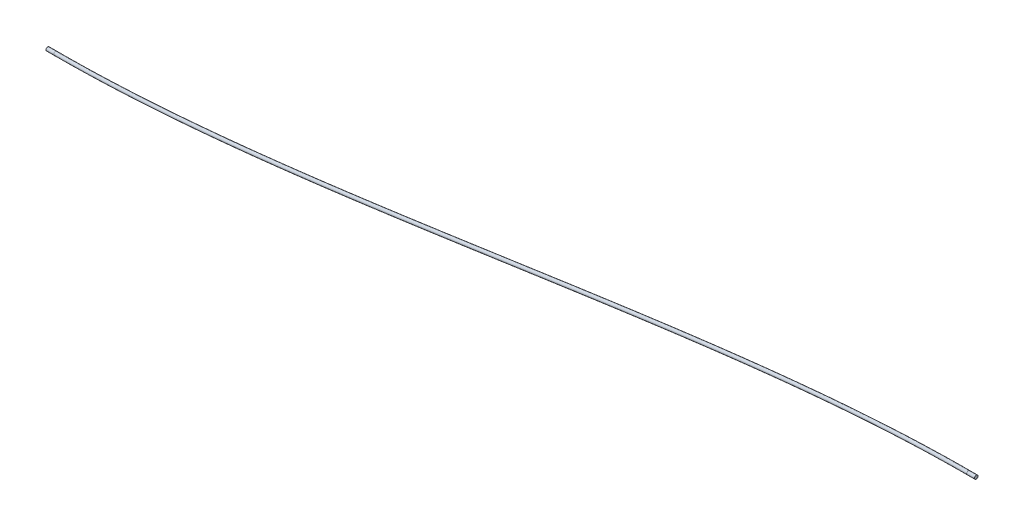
ISO-10303-21;
HEADER;
FILE_DESCRIPTION(('STEP AP214'),'2;1');
FILE_NAME('part.step','',(''),(''),'','','');
FILE_SCHEMA(('AUTOMOTIVE_DESIGN { 1 0 10303 214 1 1 1 1 }'));
ENDSEC;
DATA;
#1=APPLICATION_CONTEXT('core data for automotive mechanical design processes');
#2=APPLICATION_PROTOCOL_DEFINITION('international standard','automotive_design',2000,#1);
#3=PRODUCT_CONTEXT('',#1,'mechanical');
#4=PRODUCT('Part','Part','',(#3));
#5=PRODUCT_RELATED_PRODUCT_CATEGORY('part','',(#4));
#6=PRODUCT_DEFINITION_FORMATION('','',#4);
#7=PRODUCT_DEFINITION_CONTEXT('part definition',#1,'design');
#8=PRODUCT_DEFINITION('design','',#6,#7);
#9=PRODUCT_DEFINITION_SHAPE('','',#8);
#10=(LENGTH_UNIT() NAMED_UNIT(*) SI_UNIT(.MILLI.,.METRE.));
#11=(NAMED_UNIT(*) PLANE_ANGLE_UNIT() SI_UNIT($,.RADIAN.));
#12=(NAMED_UNIT(*) SI_UNIT($,.STERADIAN.) SOLID_ANGLE_UNIT());
#13=UNCERTAINTY_MEASURE_WITH_UNIT(LENGTH_MEASURE(1.E-05),#10,'distance_accuracy_value','');
#14=(GEOMETRIC_REPRESENTATION_CONTEXT(3) GLOBAL_UNCERTAINTY_ASSIGNED_CONTEXT((#13)) GLOBAL_UNIT_ASSIGNED_CONTEXT((#10,
#11,#12)) REPRESENTATION_CONTEXT('',''));
#15=CARTESIAN_POINT('',(0.,0.,0.));
#16=DIRECTION('',(0.,0.,1.));
#17=DIRECTION('',(1.,0.,0.));
#18=AXIS2_PLACEMENT_3D('',#15,#16,#17);
#19=CARTESIAN_POINT('',(358.887,44.4500000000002,-135.9));
#20=DIRECTION('',(1.,0.,0.));
#21=DIRECTION('',(0.,0.,-1.));
#22=AXIS2_PLACEMENT_3D('',#19,#20,#21);
#23=CYLINDRICAL_SURFACE('',#22,1.5875);
#24=CARTESIAN_POINT('',(358.887,44.4500000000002,-135.9));
#25=DIRECTION('',(1.,0.,0.));
#26=DIRECTION('',(0.,0.,-1.));
#27=AXIS2_PLACEMENT_3D('',#24,#25,#26);
#28=CIRCLE('',#27,1.5875);
#29=CARTESIAN_POINT('',(358.887,44.4500000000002,-137.4875));
#30=VERTEX_POINT('',#29);
#31=EDGE_CURVE('E62',#30,#30,#28,.T.);
#32=CARTESIAN_POINT('',(365.887,44.4500000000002,-135.9));
#33=DIRECTION('',(1.,0.,0.));
#34=DIRECTION('',(0.,0.,-1.));
#35=AXIS2_PLACEMENT_3D('',#32,#33,#34);
#36=CIRCLE('',#35,1.5875);
#37=CARTESIAN_POINT('',(365.887,44.4500000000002,-137.4875));
#38=VERTEX_POINT('',#37);
#39=EDGE_CURVE('E11',#38,#38,#36,.T.);
#40=CARTESIAN_POINT('',(358.887,44.4500000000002,-137.4875));
#41=CARTESIAN_POINT('',(358.959916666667,44.4500000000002,-137.4875));
#42=CARTESIAN_POINT('',(359.032833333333,44.4500000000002,-137.4875));
#43=CARTESIAN_POINT('',(359.178666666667,44.4500000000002,-137.4875));
#44=CARTESIAN_POINT('',(359.251583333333,44.4500000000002,-137.4875));
#45=CARTESIAN_POINT('',(359.397416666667,44.4500000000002,-137.4875));
#46=CARTESIAN_POINT('',(359.470333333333,44.4500000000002,-137.4875));
#47=CARTESIAN_POINT('',(359.616166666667,44.4500000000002,-137.4875));
#48=CARTESIAN_POINT('',(359.689083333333,44.4500000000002,-137.4875));
#49=CARTESIAN_POINT('',(359.834916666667,44.4500000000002,-137.4875));
#50=CARTESIAN_POINT('',(359.907833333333,44.4500000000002,-137.4875));
#51=CARTESIAN_POINT('',(360.053666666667,44.4500000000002,-137.4875));
#52=CARTESIAN_POINT('',(360.126583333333,44.4500000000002,-137.4875));
#53=CARTESIAN_POINT('',(360.272416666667,44.4500000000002,-137.4875));
#54=CARTESIAN_POINT('',(360.345333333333,44.4500000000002,-137.4875));
#55=CARTESIAN_POINT('',(360.491166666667,44.4500000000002,-137.4875));
#56=CARTESIAN_POINT('',(360.564083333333,44.4500000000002,-137.4875));
#57=CARTESIAN_POINT('',(360.709916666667,44.4500000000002,-137.4875));
#58=CARTESIAN_POINT('',(360.782833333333,44.4500000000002,-137.4875));
#59=CARTESIAN_POINT('',(360.928666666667,44.4500000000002,-137.4875));
#60=CARTESIAN_POINT('',(361.001583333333,44.4500000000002,-137.4875));
#61=CARTESIAN_POINT('',(361.147416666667,44.4500000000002,-137.4875));
#62=CARTESIAN_POINT('',(361.220333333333,44.4500000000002,-137.4875));
#63=CARTESIAN_POINT('',(361.366166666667,44.4500000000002,-137.4875));
#64=CARTESIAN_POINT('',(361.439083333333,44.4500000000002,-137.4875));
#65=CARTESIAN_POINT('',(361.584916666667,44.4500000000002,-137.4875));
#66=CARTESIAN_POINT('',(361.657833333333,44.4500000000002,-137.4875));
#67=CARTESIAN_POINT('',(361.803666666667,44.4500000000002,-137.4875));
#68=CARTESIAN_POINT('',(361.876583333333,44.4500000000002,-137.4875));
#69=CARTESIAN_POINT('',(362.022416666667,44.4500000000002,-137.4875));
#70=CARTESIAN_POINT('',(362.095333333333,44.4500000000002,-137.4875));
#71=CARTESIAN_POINT('',(362.241166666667,44.4500000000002,-137.4875));
#72=CARTESIAN_POINT('',(362.314083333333,44.4500000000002,-137.4875));
#73=CARTESIAN_POINT('',(362.459916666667,44.4500000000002,-137.4875));
#74=CARTESIAN_POINT('',(362.532833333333,44.4500000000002,-137.4875));
#75=CARTESIAN_POINT('',(362.678666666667,44.4500000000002,-137.4875));
#76=CARTESIAN_POINT('',(362.751583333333,44.4500000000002,-137.4875));
#77=CARTESIAN_POINT('',(362.897416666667,44.4500000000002,-137.4875));
#78=CARTESIAN_POINT('',(362.970333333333,44.4500000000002,-137.4875));
#79=CARTESIAN_POINT('',(363.116166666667,44.4500000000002,-137.4875));
#80=CARTESIAN_POINT('',(363.189083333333,44.4500000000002,-137.4875));
#81=CARTESIAN_POINT('',(363.334916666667,44.4500000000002,-137.4875));
#82=CARTESIAN_POINT('',(363.407833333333,44.4500000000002,-137.4875));
#83=CARTESIAN_POINT('',(363.553666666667,44.4500000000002,-137.4875));
#84=CARTESIAN_POINT('',(363.626583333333,44.4500000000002,-137.4875));
#85=CARTESIAN_POINT('',(363.772416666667,44.4500000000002,-137.4875));
#86=CARTESIAN_POINT('',(363.845333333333,44.4500000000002,-137.4875));
#87=CARTESIAN_POINT('',(363.991166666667,44.4500000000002,-137.4875));
#88=CARTESIAN_POINT('',(364.064083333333,44.4500000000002,-137.4875));
#89=CARTESIAN_POINT('',(364.209916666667,44.4500000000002,-137.4875));
#90=CARTESIAN_POINT('',(364.282833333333,44.4500000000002,-137.4875));
#91=CARTESIAN_POINT('',(364.428666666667,44.4500000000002,-137.4875));
#92=CARTESIAN_POINT('',(364.501583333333,44.4500000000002,-137.4875));
#93=CARTESIAN_POINT('',(364.647416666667,44.4500000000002,-137.4875));
#94=CARTESIAN_POINT('',(364.720333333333,44.4500000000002,-137.4875));
#95=CARTESIAN_POINT('',(364.866166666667,44.4500000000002,-137.4875));
#96=CARTESIAN_POINT('',(364.939083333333,44.4500000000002,-137.4875));
#97=CARTESIAN_POINT('',(365.084916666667,44.4500000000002,-137.4875));
#98=CARTESIAN_POINT('',(365.157833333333,44.4500000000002,-137.4875));
#99=CARTESIAN_POINT('',(365.303666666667,44.4500000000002,-137.4875));
#100=CARTESIAN_POINT('',(365.376583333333,44.4500000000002,-137.4875));
#101=CARTESIAN_POINT('',(365.522416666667,44.4500000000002,-137.4875));
#102=CARTESIAN_POINT('',(365.595333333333,44.4500000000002,-137.4875));
#103=CARTESIAN_POINT('',(365.741166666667,44.4500000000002,-137.4875));
#104=CARTESIAN_POINT('',(365.814083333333,44.4500000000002,-137.4875));
#105=CARTESIAN_POINT('',(365.887,44.4500000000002,-137.4875));
#106=B_SPLINE_CURVE_WITH_KNOTS('',3,(#40,#41,#42,#43,#44,#45,#46,#47,#48,#49,#50,#51,#52,#53,
#54,#55,#56,#57,#58,#59,#60,#61,#62,#63,#64,#65,#66,#67,#68,#69,#70,#71,#72,#73,#74,#75,#76,#77,
#78,#79,#80,#81,#82,#83,#84,#85,#86,#87,#88,#89,#90,#91,#92,#93,#94,#95,#96,#97,#98,#99,#100,
#101,#102,#103,#104,#105),.UNSPECIFIED.,.F.,.F.,(4,2,2,2,2,2,2,2,2,2,2,2,2,2,2,2,2,2,2,2,2,2,2,
2,2,2,2,2,2,2,2,2,4),(0.,0.21874999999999,0.43749999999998,0.656249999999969,0.874999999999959,
1.09374999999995,1.31249999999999,1.53124999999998,1.74999999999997,1.96874999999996,
2.18749999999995,2.40625,2.62499999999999,2.84374999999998,3.06249999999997,3.28124999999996,
3.49999999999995,3.71874999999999,3.93749999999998,4.15624999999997,4.37499999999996,
4.59374999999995,4.8125,5.03124999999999,5.24999999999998,5.46874999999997,5.68749999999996,
5.90625,6.12499999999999,6.34374999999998,6.56249999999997,6.78124999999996,6.99999999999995),.UNSPECIFIED.);
#107=EDGE_CURVE('BSEAM47',#30,#38,#106,.T.);
#108=ORIENTED_EDGE('',*,*,#31,.T.);
#109=ORIENTED_EDGE('',*,*,#39,.F.);
#110=ORIENTED_EDGE('',*,*,#107,.T.);
#111=ORIENTED_EDGE('',*,*,#107,.F.);
#112=EDGE_LOOP('',(#108,#110,#109,#111));
#113=FACE_BOUND('',#112,.T.);
#114=ADVANCED_FACE('F47',(#113),#23,.T.);
#115=CARTESIAN_POINT('',(-358.887,65.8188168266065,-30.3879999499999));
#116=DIRECTION('',(-1.,0.,0.));
#117=DIRECTION('',(0.,0.,1.));
#118=AXIS2_PLACEMENT_3D('',#115,#116,#117);
#119=CYLINDRICAL_SURFACE('',#118,1.5875);
#120=CARTESIAN_POINT('',(-358.887,65.8188168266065,-30.3879999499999));
#121=DIRECTION('',(1.,0.,0.));
#122=DIRECTION('',(0.,0.,-1.));
#123=AXIS2_PLACEMENT_3D('',#120,#121,#122);
#124=CIRCLE('',#123,1.5875);
#125=CARTESIAN_POINT('',(-358.887,65.8188168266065,-28.8004999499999));
#126=VERTEX_POINT('',#125);
#127=EDGE_CURVE('E53',#126,#126,#124,.T.);
#128=CARTESIAN_POINT('',(-365.887,65.8188168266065,-30.3879999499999));
#129=DIRECTION('',(1.,0.,0.));
#130=DIRECTION('',(0.,0.,-1.));
#131=AXIS2_PLACEMENT_3D('',#128,#129,#130);
#132=CIRCLE('',#131,1.5875);
#133=CARTESIAN_POINT('',(-365.887,65.8188168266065,-28.8004999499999));
#134=VERTEX_POINT('',#133);
#135=EDGE_CURVE('E57',#134,#134,#132,.T.);
#136=CARTESIAN_POINT('',(-358.887,65.8188168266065,-28.8004999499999));
#137=CARTESIAN_POINT('',(-358.959916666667,65.8188168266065,-28.8004999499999));
#138=CARTESIAN_POINT('',(-359.032833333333,65.8188168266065,-28.8004999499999));
#139=CARTESIAN_POINT('',(-359.178666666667,65.8188168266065,-28.8004999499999));
#140=CARTESIAN_POINT('',(-359.251583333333,65.8188168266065,-28.8004999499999));
#141=CARTESIAN_POINT('',(-359.397416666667,65.8188168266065,-28.8004999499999));
#142=CARTESIAN_POINT('',(-359.470333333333,65.8188168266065,-28.8004999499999));
#143=CARTESIAN_POINT('',(-359.616166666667,65.8188168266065,-28.8004999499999));
#144=CARTESIAN_POINT('',(-359.689083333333,65.8188168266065,-28.8004999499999));
#145=CARTESIAN_POINT('',(-359.834916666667,65.8188168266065,-28.8004999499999));
#146=CARTESIAN_POINT('',(-359.907833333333,65.8188168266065,-28.8004999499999));
#147=CARTESIAN_POINT('',(-360.053666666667,65.8188168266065,-28.8004999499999));
#148=CARTESIAN_POINT('',(-360.126583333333,65.8188168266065,-28.8004999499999));
#149=CARTESIAN_POINT('',(-360.272416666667,65.8188168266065,-28.8004999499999));
#150=CARTESIAN_POINT('',(-360.345333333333,65.8188168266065,-28.8004999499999));
#151=CARTESIAN_POINT('',(-360.491166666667,65.8188168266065,-28.8004999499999));
#152=CARTESIAN_POINT('',(-360.564083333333,65.8188168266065,-28.8004999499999));
#153=CARTESIAN_POINT('',(-360.709916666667,65.8188168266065,-28.8004999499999));
#154=CARTESIAN_POINT('',(-360.782833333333,65.8188168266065,-28.8004999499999));
#155=CARTESIAN_POINT('',(-360.928666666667,65.8188168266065,-28.8004999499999));
#156=CARTESIAN_POINT('',(-361.001583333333,65.8188168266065,-28.8004999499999));
#157=CARTESIAN_POINT('',(-361.147416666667,65.8188168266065,-28.8004999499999));
#158=CARTESIAN_POINT('',(-361.220333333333,65.8188168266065,-28.8004999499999));
#159=CARTESIAN_POINT('',(-361.366166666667,65.8188168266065,-28.8004999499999));
#160=CARTESIAN_POINT('',(-361.439083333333,65.8188168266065,-28.8004999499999));
#161=CARTESIAN_POINT('',(-361.584916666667,65.8188168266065,-28.8004999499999));
#162=CARTESIAN_POINT('',(-361.657833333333,65.8188168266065,-28.8004999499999));
#163=CARTESIAN_POINT('',(-361.803666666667,65.8188168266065,-28.8004999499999));
#164=CARTESIAN_POINT('',(-361.876583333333,65.8188168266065,-28.8004999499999));
#165=CARTESIAN_POINT('',(-362.022416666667,65.8188168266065,-28.8004999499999));
#166=CARTESIAN_POINT('',(-362.095333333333,65.8188168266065,-28.8004999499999));
#167=CARTESIAN_POINT('',(-362.241166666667,65.8188168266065,-28.8004999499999));
#168=CARTESIAN_POINT('',(-362.314083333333,65.8188168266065,-28.8004999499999));
#169=CARTESIAN_POINT('',(-362.459916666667,65.8188168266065,-28.8004999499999));
#170=CARTESIAN_POINT('',(-362.532833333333,65.8188168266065,-28.8004999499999));
#171=CARTESIAN_POINT('',(-362.678666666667,65.8188168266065,-28.8004999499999));
#172=CARTESIAN_POINT('',(-362.751583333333,65.8188168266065,-28.8004999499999));
#173=CARTESIAN_POINT('',(-362.897416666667,65.8188168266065,-28.8004999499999));
#174=CARTESIAN_POINT('',(-362.970333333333,65.8188168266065,-28.8004999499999));
#175=CARTESIAN_POINT('',(-363.116166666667,65.8188168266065,-28.8004999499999));
#176=CARTESIAN_POINT('',(-363.189083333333,65.8188168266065,-28.8004999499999));
#177=CARTESIAN_POINT('',(-363.334916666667,65.8188168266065,-28.8004999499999));
#178=CARTESIAN_POINT('',(-363.407833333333,65.8188168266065,-28.8004999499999));
#179=CARTESIAN_POINT('',(-363.553666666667,65.8188168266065,-28.8004999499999));
#180=CARTESIAN_POINT('',(-363.626583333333,65.8188168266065,-28.8004999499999));
#181=CARTESIAN_POINT('',(-363.772416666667,65.8188168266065,-28.8004999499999));
#182=CARTESIAN_POINT('',(-363.845333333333,65.8188168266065,-28.8004999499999));
#183=CARTESIAN_POINT('',(-363.991166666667,65.8188168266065,-28.8004999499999));
#184=CARTESIAN_POINT('',(-364.064083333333,65.8188168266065,-28.8004999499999));
#185=CARTESIAN_POINT('',(-364.209916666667,65.8188168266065,-28.8004999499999));
#186=CARTESIAN_POINT('',(-364.282833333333,65.8188168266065,-28.8004999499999));
#187=CARTESIAN_POINT('',(-364.428666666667,65.8188168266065,-28.8004999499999));
#188=CARTESIAN_POINT('',(-364.501583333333,65.8188168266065,-28.8004999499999));
#189=CARTESIAN_POINT('',(-364.647416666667,65.8188168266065,-28.8004999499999));
#190=CARTESIAN_POINT('',(-364.720333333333,65.8188168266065,-28.8004999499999));
#191=CARTESIAN_POINT('',(-364.866166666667,65.8188168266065,-28.8004999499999));
#192=CARTESIAN_POINT('',(-364.939083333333,65.8188168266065,-28.8004999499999));
#193=CARTESIAN_POINT('',(-365.084916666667,65.8188168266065,-28.8004999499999));
#194=CARTESIAN_POINT('',(-365.157833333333,65.8188168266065,-28.8004999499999));
#195=CARTESIAN_POINT('',(-365.303666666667,65.8188168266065,-28.8004999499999));
#196=CARTESIAN_POINT('',(-365.376583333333,65.8188168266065,-28.8004999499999));
#197=CARTESIAN_POINT('',(-365.522416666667,65.8188168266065,-28.8004999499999));
#198=CARTESIAN_POINT('',(-365.595333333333,65.8188168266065,-28.8004999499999));
#199=CARTESIAN_POINT('',(-365.741166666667,65.8188168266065,-28.8004999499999));
#200=CARTESIAN_POINT('',(-365.814083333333,65.8188168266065,-28.8004999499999));
#201=CARTESIAN_POINT('',(-365.887,65.8188168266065,-28.8004999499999));
#202=B_SPLINE_CURVE_WITH_KNOTS('',3,(#136,#137,#138,#139,#140,#141,#142,#143,#144,#145,#146,
#147,#148,#149,#150,#151,#152,#153,#154,#155,#156,#157,#158,#159,#160,#161,#162,#163,#164,#165,
#166,#167,#168,#169,#170,#171,#172,#173,#174,#175,#176,#177,#178,#179,#180,#181,#182,#183,#184,
#185,#186,#187,#188,#189,#190,#191,#192,#193,#194,#195,#196,#197,#198,#199,#200,#201),
.UNSPECIFIED.,.F.,.F.,(4,2,2,2,2,2,2,2,2,2,2,2,2,2,2,2,2,2,2,2,2,2,2,2,2,2,2,2,2,2,2,2,4),(0.,
0.218750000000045,0.437500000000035,0.656250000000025,0.875000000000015,1.09375,
1.31250000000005,1.53125000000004,1.75000000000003,1.96875000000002,2.18750000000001,
2.40625000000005,2.62500000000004,2.84375000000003,3.06250000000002,3.28125000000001,
3.50000000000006,3.71875000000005,3.93750000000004,4.15625000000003,4.37500000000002,
4.59375000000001,4.81250000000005,5.03125000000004,5.25000000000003,5.46875000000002,
5.68750000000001,5.90625000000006,6.12500000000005,6.34375000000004,6.56250000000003,
6.78125000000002,7.00000000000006),.UNSPECIFIED.);
#203=EDGE_CURVE('BSEAM81',#126,#134,#202,.T.);
#204=ORIENTED_EDGE('',*,*,#127,.F.);
#205=ORIENTED_EDGE('',*,*,#135,.T.);
#206=ORIENTED_EDGE('',*,*,#203,.T.);
#207=ORIENTED_EDGE('',*,*,#203,.F.);
#208=EDGE_LOOP('',(#204,#206,#205,#207));
#209=FACE_BOUND('',#208,.T.);
#210=ADVANCED_FACE('F81',(#209),#119,.T.);
#211=CARTESIAN_POINT('',(-365.887,65.8188168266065,-30.3879999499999));
#212=DIRECTION('',(1.,0.,0.));
#213=DIRECTION('',(0.,0.,-1.));
#214=AXIS2_PLACEMENT_3D('',#211,#212,#213);
#215=PLANE('',#214);
#216=ORIENTED_EDGE('',*,*,#135,.F.);
#217=EDGE_LOOP('',(#216));
#218=FACE_BOUND('',#217,.T.);
#219=ADVANCED_FACE('F76',(#218),#215,.F.);
#220=CARTESIAN_POINT('',(365.887,44.4500000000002,-135.9));
#221=DIRECTION('',(1.,0.,0.));
#222=DIRECTION('',(0.,0.,-1.));
#223=AXIS2_PLACEMENT_3D('',#220,#221,#222);
#224=PLANE('',#223);
#225=ORIENTED_EDGE('',*,*,#39,.T.);
#226=EDGE_LOOP('',(#225));
#227=FACE_BOUND('',#226,.T.);
#228=ADVANCED_FACE('F71',(#227),#224,.T.);
#229=CARTESIAN_POINT('',(-358.887,65.8188168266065,-31.9754999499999));
#230=CARTESIAN_POINT('',(-291.129645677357,65.8188168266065,-31.9754999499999));
#231=CARTESIAN_POINT('',(-157.281393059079,62.4741311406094,-48.4904281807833));
#232=CARTESIAN_POINT('',(28.146648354,53.7031909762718,-91.7983682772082));
#233=CARTESIAN_POINT('',(199.655956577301,46.522294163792,-127.255211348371));
#234=CARTESIAN_POINT('',(305.649078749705,44.4500000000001,-137.4875));
#235=CARTESIAN_POINT('',(358.887,44.4500000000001,-137.4875));
#236=CARTESIAN_POINT('',(-358.887,68.9938168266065,-31.9754999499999));
#237=CARTESIAN_POINT('',(-290.850150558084,68.9938168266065,-31.9754999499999));
#238=CARTESIAN_POINT('',(-157.270134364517,65.6467232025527,-48.5023177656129));
#239=CARTESIAN_POINT('',(28.3497977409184,56.8745982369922,-91.8161080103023));
#240=CARTESIAN_POINT('',(199.665365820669,49.6957579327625,-127.262796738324));
#241=CARTESIAN_POINT('',(305.887303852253,47.6250000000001,-137.4875));
#242=CARTESIAN_POINT('',(358.887,47.6250000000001,-137.4875));
#243=CARTESIAN_POINT('',(-358.887,68.9938168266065,-28.8004999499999));
#244=CARTESIAN_POINT('',(-290.850150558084,68.9938168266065,-28.8004999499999));
#245=CARTESIAN_POINT('',(-156.508006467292,65.6348336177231,-45.386024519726));
#246=CARTESIAN_POINT('',(29.0293207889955,56.856858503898,-88.7287008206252));
#247=CARTESIAN_POINT('',(200.286990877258,49.6881725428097,-124.125250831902));
#248=CARTESIAN_POINT('',(305.887303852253,47.6250000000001,-134.3125));
#249=CARTESIAN_POINT('',(358.887,47.6250000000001,-134.3125));
#250=CARTESIAN_POINT('',(-358.887,65.8188168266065,-28.8004999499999));
#251=CARTESIAN_POINT('',(-290.989898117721,65.8188168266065,-28.8004999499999));
#252=CARTESIAN_POINT('',(-156.590810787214,62.4622415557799,-45.3741349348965));
#253=CARTESIAN_POINT('',(28.8589358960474,53.6854512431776,-88.7109610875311));
#254=CARTESIAN_POINT('',(200.219338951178,46.5147087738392,-124.117665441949));
#255=CARTESIAN_POINT('',(305.768191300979,44.4500000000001,-134.3125));
#256=CARTESIAN_POINT('',(358.887,44.4500000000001,-134.3125));
#257=CARTESIAN_POINT('',(-358.887,62.6438168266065,-28.8004999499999));
#258=CARTESIAN_POINT('',(-291.129645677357,62.6438168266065,-28.8004999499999));
#259=CARTESIAN_POINT('',(-156.673615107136,59.2896494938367,-45.362245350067));
#260=CARTESIAN_POINT('',(28.6885510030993,50.5140439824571,-88.6932213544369));
#261=CARTESIAN_POINT('',(200.151687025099,43.3412450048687,-124.110080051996));
#262=CARTESIAN_POINT('',(305.649078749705,41.2750000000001,-134.3125));
#263=CARTESIAN_POINT('',(358.887,41.2750000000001,-134.3125));
#264=CARTESIAN_POINT('',(-358.887,62.6438168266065,-31.9754999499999));
#265=CARTESIAN_POINT('',(-291.409140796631,62.6438168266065,-31.9754999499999));
#266=CARTESIAN_POINT('',(-157.292651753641,59.3015390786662,-48.4785385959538));
#267=CARTESIAN_POINT('',(27.9434989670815,50.5317837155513,-91.780628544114));
#268=CARTESIAN_POINT('',(199.646547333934,43.3488303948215,-127.247625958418));
#269=CARTESIAN_POINT('',(305.410853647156,41.2750000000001,-137.4875));
#270=CARTESIAN_POINT('',(358.887,41.2750000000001,-137.4875));
#271=CARTESIAN_POINT('',(-358.887,65.8188168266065,-31.9754999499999));
#272=CARTESIAN_POINT('',(-291.129645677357,65.8188168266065,-31.9754999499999));
#273=CARTESIAN_POINT('',(-157.281393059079,62.4741311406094,-48.4904281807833));
#274=CARTESIAN_POINT('',(28.146648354,53.7031909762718,-91.7983682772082));
#275=CARTESIAN_POINT('',(199.655956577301,46.522294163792,-127.255211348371));
#276=CARTESIAN_POINT('',(305.649078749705,44.4500000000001,-137.4875));
#277=CARTESIAN_POINT('',(358.887,44.4500000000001,-137.4875));
#278=(BOUNDED_SURFACE() B_SPLINE_SURFACE(3,3,((#229,#230,#231,#232,#233,#234,#235),(#236,#237,
#238,#239,#240,#241,#242),(#243,#244,#245,#246,#247,#248,#249),(#250,#251,#252,#253,#254,#255,
#256),(#257,#258,#259,#260,#261,#262,#263),(#264,#265,#266,#267,#268,#269,#270),(#271,#272,#273,
#274,#275,#276,#277)),.UNSPECIFIED.,.T.,.F.,.F.) B_SPLINE_SURFACE_WITH_KNOTS((4,3,4),(4,1,1,1,
4),(0.,0.5,1.),(0.,0.28,0.56,0.78,1.),
.UNSPECIFIED.) GEOMETRIC_REPRESENTATION_ITEM() RATIONAL_B_SPLINE_SURFACE(((1.,1.,1.,1.,1.,1.,
1.),(0.333333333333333,0.333333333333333,0.333333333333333,0.333333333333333,0.333333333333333,
0.333333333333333,0.333333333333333),(0.333333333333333,0.333333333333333,0.333333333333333,
0.333333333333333,0.333333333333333,0.333333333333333,0.333333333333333),(1.,1.,1.,1.,1.,1.,1.),
(0.333333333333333,0.333333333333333,0.333333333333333,0.333333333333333,0.333333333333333,
0.333333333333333,0.333333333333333),(0.333333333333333,0.333333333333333,0.333333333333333,
0.333333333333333,0.333333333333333,0.333333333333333,0.333333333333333),(1.,1.,1.,1.,1.,1.,1.))) REPRESENTATION_ITEM('') SURFACE());
#279=ORIENTED_EDGE('',*,*,#127,.T.);
#280=EDGE_LOOP('',(#279));
#281=FACE_BOUND('',#280,.T.);
#282=ORIENTED_EDGE('',*,*,#31,.F.);
#283=EDGE_LOOP('',(#282));
#284=FACE_BOUND('',#283,.T.);
#285=ADVANCED_FACE('F69',(#281,#284),#278,.T.);
#286=CLOSED_SHELL('',(#114,#210,#219,#228,#285));
#287=MANIFOLD_SOLID_BREP('B2',#286);
#288=ADVANCED_BREP_SHAPE_REPRESENTATION('',(#18,#287),#14);
#289=SHAPE_DEFINITION_REPRESENTATION(#9,#288);
ENDSEC;
END-ISO-10303-21;
